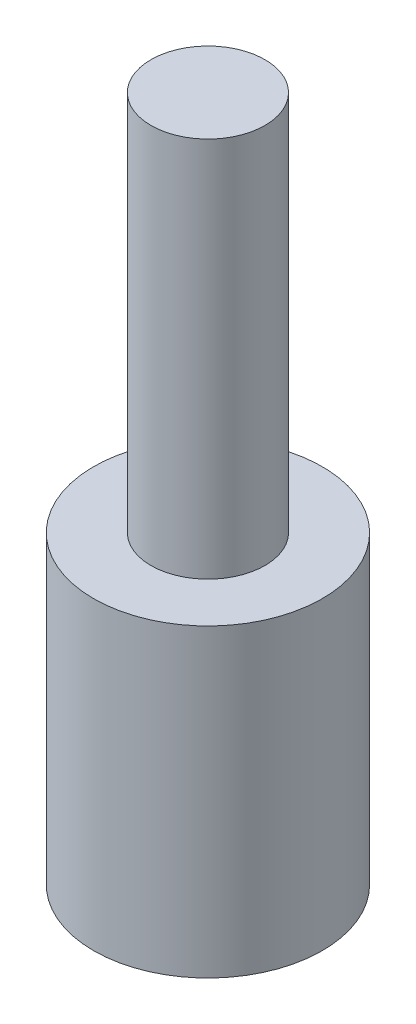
from build123d import *

# Parameters (mm, degrees)
SKETCH1_R           = 4.7625
BOSS_EXTRUDE1_DEPTH = 12.7
SKETCH2_R           = 2.3749
BOSS_EXTRUDE2_DEPTH = 15.875
SKETCH3_R           = 2.2225
CUT_EXTRUDE1_DEPTH  = 9.525


with BuildPart() as part:
    # Sketch1 → Boss-Extrude1 (new body)
    with BuildSketch(Plane(origin=(0, 0, 0), x_dir=(1, 0, 0), z_dir=(0, 1, 0))):
        with Locations(Location((0, 0, 0), (0, 0, 270))):
            Circle(SKETCH1_R)
    extrude(amount=BOSS_EXTRUDE1_DEPTH)

    # Sketch2 → Boss-Extrude2 (add)
    with BuildSketch(Plane(origin=(0, 12.7, 0), x_dir=(1, 0, 0), z_dir=(0, 1, 0))):
        with Locations(Location((0, 0, 0), (0, 0, 270))):
            Circle(SKETCH2_R)
    extrude(amount=BOSS_EXTRUDE2_DEPTH)

    # Sketch3 → Cut-Extrude1 (cut)
    with BuildSketch(Plane.XZ):
        with Locations(Location((0, 0, 0), (0, 0, 270))):
            Circle(SKETCH3_R)
    extrude(amount=-CUT_EXTRUDE1_DEPTH, mode=Mode.SUBTRACT)


solid = part.part
